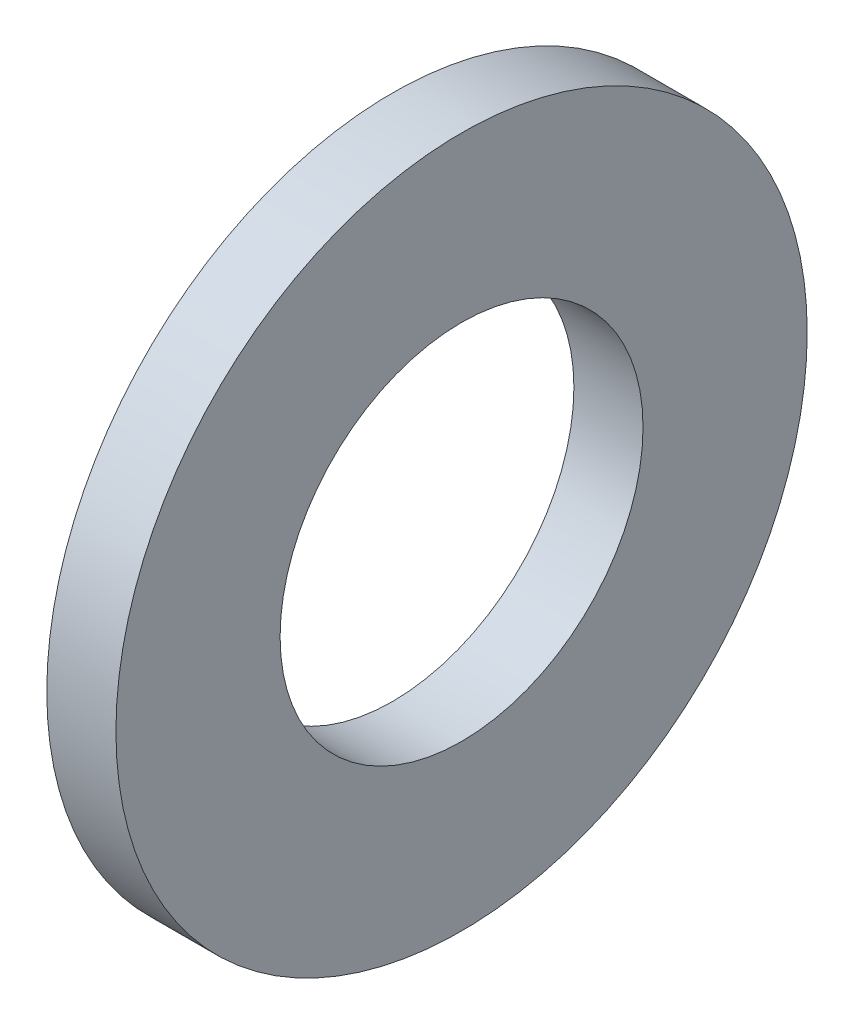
from build123d import *

# Parameters (mm, degrees)
ESQUISSE1_W = 2
ESQUISSE1_H = 4.75


with BuildPart() as part:
    # Esquisse1 → Base-R_volution (revolve)
    with BuildSketch(Plane(origin=(0, 0, 0), x_dir=(1, 0, 0), z_dir=(0, 1, 0)), mode=Mode.PRIVATE) as base_r_volution_sk:
        with Locations((1, 7.625)):
            Rectangle(ESQUISSE1_W, ESQUISSE1_H)
    revolve(base_r_volution_sk.sketch.rotate(Axis((0, 0, 0), (1, 0, 0)), 180), axis=Axis((0, 0, 0), (1, 0, 0)))


solid = part.part
